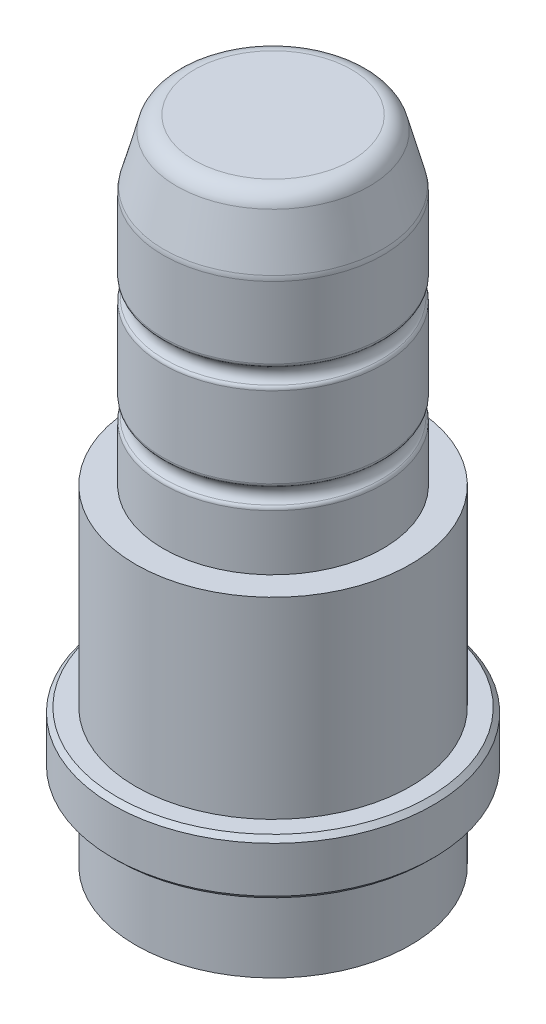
ISO-10303-21;
HEADER;
FILE_DESCRIPTION(('STEP AP214'),'2;1');
FILE_NAME('part.step','',(''),(''),'','','');
FILE_SCHEMA(('AUTOMOTIVE_DESIGN { 1 0 10303 214 1 1 1 1 }'));
ENDSEC;
DATA;
#1=APPLICATION_CONTEXT('core data for automotive mechanical design processes');
#2=APPLICATION_PROTOCOL_DEFINITION('international standard','automotive_design',2000,#1);
#3=PRODUCT_CONTEXT('',#1,'mechanical');
#4=PRODUCT('Part','Part','',(#3));
#5=PRODUCT_RELATED_PRODUCT_CATEGORY('part','',(#4));
#6=PRODUCT_DEFINITION_FORMATION('','',#4);
#7=PRODUCT_DEFINITION_CONTEXT('part definition',#1,'design');
#8=PRODUCT_DEFINITION('design','',#6,#7);
#9=PRODUCT_DEFINITION_SHAPE('','',#8);
#10=(LENGTH_UNIT() NAMED_UNIT(*) SI_UNIT(.MILLI.,.METRE.));
#11=(NAMED_UNIT(*) PLANE_ANGLE_UNIT() SI_UNIT($,.RADIAN.));
#12=(NAMED_UNIT(*) SI_UNIT($,.STERADIAN.) SOLID_ANGLE_UNIT());
#13=UNCERTAINTY_MEASURE_WITH_UNIT(LENGTH_MEASURE(1.E-05),#10,'distance_accuracy_value','');
#14=(GEOMETRIC_REPRESENTATION_CONTEXT(3) GLOBAL_UNCERTAINTY_ASSIGNED_CONTEXT((#13)) GLOBAL_UNIT_ASSIGNED_CONTEXT((#10,
#11,#12)) REPRESENTATION_CONTEXT('',''));
#15=CARTESIAN_POINT('',(0.,0.,0.));
#16=DIRECTION('',(0.,0.,1.));
#17=DIRECTION('',(1.,0.,0.));
#18=AXIS2_PLACEMENT_3D('',#15,#16,#17);
#19=CARTESIAN_POINT('',(0.,6.,0.));
#20=DIRECTION('',(0.,-1.,0.));
#21=DIRECTION('',(0.,0.,-1.));
#22=AXIS2_PLACEMENT_3D('',#19,#20,#21);
#23=CYLINDRICAL_SURFACE('',#22,17.5);
#24=CARTESIAN_POINT('',(0.,5.5,0.));
#25=DIRECTION('',(0.,1.,0.));
#26=DIRECTION('',(0.,0.,1.));
#27=AXIS2_PLACEMENT_3D('',#24,#25,#26);
#28=CIRCLE('',#27,17.5);
#29=CARTESIAN_POINT('',(0.,5.5,17.5));
#30=VERTEX_POINT('',#29);
#31=EDGE_CURVE('E21',#30,#30,#28,.F.);
#32=ORIENTED_EDGE('',*,*,#31,.T.);
#33=EDGE_LOOP('',(#32));
#34=FACE_BOUND('',#33,.T.);
#35=CARTESIAN_POINT('',(0.,0.500000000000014,0.));
#36=DIRECTION('',(0.,1.,0.));
#37=DIRECTION('',(0.,0.,1.));
#38=AXIS2_PLACEMENT_3D('',#35,#36,#37);
#39=CIRCLE('',#38,17.5);
#40=CARTESIAN_POINT('',(0.,0.500000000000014,17.5));
#41=VERTEX_POINT('',#40);
#42=EDGE_CURVE('E29',#41,#41,#39,.T.);
#43=ORIENTED_EDGE('',*,*,#42,.T.);
#44=EDGE_LOOP('',(#43));
#45=FACE_BOUND('',#44,.T.);
#46=ADVANCED_FACE('F13',(#34,#45),#23,.T.);
#47=CARTESIAN_POINT('',(0.,6.,0.));
#48=DIRECTION('',(0.,1.,0.));
#49=DIRECTION('',(0.,0.,1.));
#50=AXIS2_PLACEMENT_3D('',#47,#48,#49);
#51=PLANE('',#50);
#52=CARTESIAN_POINT('',(0.,6.,0.));
#53=DIRECTION('',(0.,1.,0.));
#54=DIRECTION('',(0.,0.,1.));
#55=AXIS2_PLACEMENT_3D('',#52,#53,#54);
#56=CIRCLE('',#55,17.);
#57=CARTESIAN_POINT('',(0.,6.,17.));
#58=VERTEX_POINT('',#57);
#59=EDGE_CURVE('E36',#58,#58,#56,.T.);
#60=ORIENTED_EDGE('',*,*,#59,.T.);
#61=EDGE_LOOP('',(#60));
#62=FACE_BOUND('',#61,.T.);
#63=CARTESIAN_POINT('',(0.,6.,0.));
#64=DIRECTION('',(0.,-1.,0.));
#65=DIRECTION('',(0.,0.,-1.));
#66=AXIS2_PLACEMENT_3D('',#63,#64,#65);
#67=CIRCLE('',#66,15.);
#68=CARTESIAN_POINT('',(0.,6.,-15.));
#69=VERTEX_POINT('',#68);
#70=EDGE_CURVE('E47',#69,#69,#67,.T.);
#71=ORIENTED_EDGE('',*,*,#70,.T.);
#72=EDGE_LOOP('',(#71));
#73=FACE_BOUND('',#72,.T.);
#74=ADVANCED_FACE('F124',(#62,#73),#51,.T.);
#75=CARTESIAN_POINT('',(0.,0.,0.));
#76=DIRECTION('',(0.,1.,0.));
#77=DIRECTION('',(0.,0.,1.));
#78=AXIS2_PLACEMENT_3D('',#75,#76,#77);
#79=PLANE('',#78);
#80=CARTESIAN_POINT('',(0.,0.,0.));
#81=DIRECTION('',(0.,1.,0.));
#82=DIRECTION('',(0.,0.,1.));
#83=AXIS2_PLACEMENT_3D('',#80,#81,#82);
#84=CIRCLE('',#83,17.);
#85=CARTESIAN_POINT('',(0.,0.,17.));
#86=VERTEX_POINT('',#85);
#87=EDGE_CURVE('E8',#86,#86,#84,.F.);
#88=ORIENTED_EDGE('',*,*,#87,.T.);
#89=EDGE_LOOP('',(#88));
#90=FACE_BOUND('',#89,.T.);
#91=CARTESIAN_POINT('',(0.,0.,0.));
#92=DIRECTION('',(0.,1.,0.));
#93=DIRECTION('',(0.,0.,1.));
#94=AXIS2_PLACEMENT_3D('',#91,#92,#93);
#95=CIRCLE('',#94,15.);
#96=CARTESIAN_POINT('',(0.,0.,15.));
#97=VERTEX_POINT('',#96);
#98=EDGE_CURVE('E102',#97,#97,#95,.T.);
#99=ORIENTED_EDGE('',*,*,#98,.T.);
#100=EDGE_LOOP('',(#99));
#101=FACE_BOUND('',#100,.T.);
#102=ADVANCED_FACE('F107',(#90,#101),#79,.F.);
#103=CARTESIAN_POINT('',(0.,27.,0.));
#104=DIRECTION('',(0.,-1.,0.));
#105=DIRECTION('',(0.,0.,-1.));
#106=AXIS2_PLACEMENT_3D('',#103,#104,#105);
#107=PLANE('',#106);
#108=CARTESIAN_POINT('',(0.,27.,0.));
#109=DIRECTION('',(0.,1.,0.));
#110=DIRECTION('',(0.,0.,1.));
#111=AXIS2_PLACEMENT_3D('',#108,#109,#110);
#112=CIRCLE('',#111,12.);
#113=CARTESIAN_POINT('',(0.,27.,12.));
#114=VERTEX_POINT('',#113);
#115=EDGE_CURVE('E42',#114,#114,#112,.T.);
#116=ORIENTED_EDGE('',*,*,#115,.F.);
#117=EDGE_LOOP('',(#116));
#118=FACE_BOUND('',#117,.T.);
#119=CARTESIAN_POINT('',(0.,27.,0.));
#120=DIRECTION('',(0.,-1.,0.));
#121=DIRECTION('',(0.,0.,-1.));
#122=AXIS2_PLACEMENT_3D('',#119,#120,#121);
#123=CIRCLE('',#122,15.);
#124=CARTESIAN_POINT('',(0.,27.,-15.));
#125=VERTEX_POINT('',#124);
#126=EDGE_CURVE('E43',#125,#125,#123,.T.);
#127=ORIENTED_EDGE('',*,*,#126,.F.);
#128=EDGE_LOOP('',(#127));
#129=FACE_BOUND('',#128,.T.);
#130=ADVANCED_FACE('F133',(#118,#129),#107,.F.);
#131=CARTESIAN_POINT('',(0.,6.,0.));
#132=DIRECTION('',(0.,-1.,0.));
#133=DIRECTION('',(0.,0.,-1.));
#134=AXIS2_PLACEMENT_3D('',#131,#132,#133);
#135=CYLINDRICAL_SURFACE('',#134,15.);
#136=ORIENTED_EDGE('',*,*,#70,.F.);
#137=EDGE_LOOP('',(#136));
#138=FACE_BOUND('',#137,.T.);
#139=ORIENTED_EDGE('',*,*,#126,.T.);
#140=EDGE_LOOP('',(#139));
#141=FACE_BOUND('',#140,.T.);
#142=ADVANCED_FACE('F137',(#138,#141),#135,.T.);
#143=CARTESIAN_POINT('',(0.,62.,0.));
#144=DIRECTION('',(0.,1.,0.));
#145=DIRECTION('',(0.,0.,1.));
#146=AXIS2_PLACEMENT_3D('',#143,#144,#145);
#147=PLANE('',#146);
#148=CARTESIAN_POINT('',(0.,62.,0.));
#149=DIRECTION('',(0.,1.,0.));
#150=DIRECTION('',(0.,0.,1.));
#151=AXIS2_PLACEMENT_3D('',#148,#149,#150);
#152=CIRCLE('',#151,8.58970167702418);
#153=CARTESIAN_POINT('',(0.,62.,8.58970167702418));
#154=VERTEX_POINT('',#153);
#155=EDGE_CURVE('E50',#154,#154,#152,.T.);
#156=ORIENTED_EDGE('',*,*,#155,.T.);
#157=EDGE_LOOP('',(#156));
#158=FACE_BOUND('',#157,.T.);
#159=ADVANCED_FACE('F141',(#158),#147,.T.);
#160=CARTESIAN_POINT('',(0.,60.,0.));
#161=DIRECTION('',(0.,1.,0.));
#162=DIRECTION('',(0.,0.,1.));
#163=AXIS2_PLACEMENT_3D('',#160,#161,#162);
#164=TOROIDAL_SURFACE('',#163,8.58970167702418,2.);
#165=CARTESIAN_POINT('',(0.,60.517638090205,0.));
#166=DIRECTION('',(0.,1.,0.));
#167=DIRECTION('',(0.,0.,1.));
#168=AXIS2_PLACEMENT_3D('',#165,#166,#167);
#169=CIRCLE('',#168,10.5215533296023);
#170=CARTESIAN_POINT('',(0.,60.517638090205,10.5215533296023));
#171=VERTEX_POINT('',#170);
#172=EDGE_CURVE('E53',#171,#171,#169,.T.);
#173=ORIENTED_EDGE('',*,*,#172,.T.);
#174=EDGE_LOOP('',(#173));
#175=FACE_BOUND('',#174,.T.);
#176=ORIENTED_EDGE('',*,*,#155,.F.);
#177=EDGE_LOOP('',(#176));
#178=FACE_BOUND('',#177,.T.);
#179=ADVANCED_FACE('F145',(#175,#178),#164,.T.);
#180=CARTESIAN_POINT('',(0.,60.517638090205,0.));
#181=DIRECTION('',(0.,-1.,0.));
#182=DIRECTION('',(0.,0.,-1.));
#183=AXIS2_PLACEMENT_3D('',#180,#181,#182);
#184=CONICAL_SURFACE('',#183,10.5215533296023,0.261799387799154);
#185=CARTESIAN_POINT('',(0.,55.2543330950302,0.));
#186=DIRECTION('',(0.,1.,0.));
#187=DIRECTION('',(0.,0.,1.));
#188=AXIS2_PLACEMENT_3D('',#185,#186,#187);
#189=CIRCLE('',#188,11.9318516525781);
#190=CARTESIAN_POINT('',(0.,55.2543330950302,11.9318516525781));
#191=VERTEX_POINT('',#190);
#192=EDGE_CURVE('E57',#191,#191,#189,.T.);
#193=ORIENTED_EDGE('',*,*,#192,.T.);
#194=EDGE_LOOP('',(#193));
#195=FACE_BOUND('',#194,.T.);
#196=ORIENTED_EDGE('',*,*,#172,.F.);
#197=EDGE_LOOP('',(#196));
#198=FACE_BOUND('',#197,.T.);
#199=ADVANCED_FACE('F149',(#195,#198),#184,.T.);
#200=CARTESIAN_POINT('',(0.,54.7366950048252,0.));
#201=DIRECTION('',(0.,1.,0.));
#202=DIRECTION('',(0.,0.,1.));
#203=AXIS2_PLACEMENT_3D('',#200,#201,#202);
#204=TOROIDAL_SURFACE('',#203,10.,2.);
#205=CARTESIAN_POINT('',(0.,54.7366950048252,0.));
#206=DIRECTION('',(0.,1.,0.));
#207=DIRECTION('',(0.,0.,1.));
#208=AXIS2_PLACEMENT_3D('',#205,#206,#207);
#209=CIRCLE('',#208,12.);
#210=CARTESIAN_POINT('',(0.,54.7366950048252,12.));
#211=VERTEX_POINT('',#210);
#212=EDGE_CURVE('E61',#211,#211,#209,.T.);
#213=ORIENTED_EDGE('',*,*,#212,.T.);
#214=EDGE_LOOP('',(#213));
#215=FACE_BOUND('',#214,.T.);
#216=ORIENTED_EDGE('',*,*,#192,.F.);
#217=EDGE_LOOP('',(#216));
#218=FACE_BOUND('',#217,.T.);
#219=ADVANCED_FACE('F153',(#215,#218),#204,.T.);
#220=CARTESIAN_POINT('',(0.,62.,0.));
#221=DIRECTION('',(0.,1.,0.));
#222=DIRECTION('',(0.,0.,1.));
#223=AXIS2_PLACEMENT_3D('',#220,#221,#222);
#224=CYLINDRICAL_SURFACE('',#223,12.);
#225=CARTESIAN_POINT('',(0.,46.9386863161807,0.));
#226=DIRECTION('',(0.,1.,0.));
#227=DIRECTION('',(0.,0.,1.));
#228=AXIS2_PLACEMENT_3D('',#225,#226,#227);
#229=CIRCLE('',#228,12.);
#230=CARTESIAN_POINT('',(0.,46.9386863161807,12.));
#231=VERTEX_POINT('',#230);
#232=EDGE_CURVE('E65',#231,#231,#229,.T.);
#233=ORIENTED_EDGE('',*,*,#232,.T.);
#234=EDGE_LOOP('',(#233));
#235=FACE_BOUND('',#234,.T.);
#236=ORIENTED_EDGE('',*,*,#212,.F.);
#237=EDGE_LOOP('',(#236));
#238=FACE_BOUND('',#237,.T.);
#239=ADVANCED_FACE('F157',(#235,#238),#224,.T.);
#240=CARTESIAN_POINT('',(0.,46.9386863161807,0.));
#241=DIRECTION('',(0.,1.,0.));
#242=DIRECTION('',(0.,0.,1.));
#243=AXIS2_PLACEMENT_3D('',#240,#241,#242);
#244=TOROIDAL_SURFACE('',#243,11.5,0.5);
#245=CARTESIAN_POINT('',(0.,46.545610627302,0.));
#246=DIRECTION('',(0.,1.,0.));
#247=DIRECTION('',(0.,0.,1.));
#248=AXIS2_PLACEMENT_3D('',#245,#246,#247);
#249=CIRCLE('',#248,11.8090169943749);
#250=CARTESIAN_POINT('',(0.,46.545610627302,11.8090169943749));
#251=VERTEX_POINT('',#250);
#252=EDGE_CURVE('E69',#251,#251,#249,.T.);
#253=ORIENTED_EDGE('',*,*,#252,.T.);
#254=EDGE_LOOP('',(#253));
#255=FACE_BOUND('',#254,.T.);
#256=ORIENTED_EDGE('',*,*,#232,.F.);
#257=EDGE_LOOP('',(#256));
#258=FACE_BOUND('',#257,.T.);
#259=ADVANCED_FACE('F161',(#255,#258),#244,.T.);
#260=CARTESIAN_POINT('',(0.,45.6666666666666,0.));
#261=DIRECTION('',(0.,1.,0.));
#262=DIRECTION('',(0.,0.,1.));
#263=AXIS2_PLACEMENT_3D('',#260,#261,#262);
#264=TOROIDAL_SURFACE('',#263,12.5,1.11803398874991);
#265=CARTESIAN_POINT('',(0.,44.7877227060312,0.));
#266=DIRECTION('',(0.,1.,0.));
#267=DIRECTION('',(0.,0.,1.));
#268=AXIS2_PLACEMENT_3D('',#265,#266,#267);
#269=CIRCLE('',#268,11.8090169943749);
#270=CARTESIAN_POINT('',(0.,44.7877227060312,11.8090169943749));
#271=VERTEX_POINT('',#270);
#272=EDGE_CURVE('E73',#271,#271,#269,.T.);
#273=ORIENTED_EDGE('',*,*,#272,.T.);
#274=EDGE_LOOP('',(#273));
#275=FACE_BOUND('',#274,.T.);
#276=ORIENTED_EDGE('',*,*,#252,.F.);
#277=EDGE_LOOP('',(#276));
#278=FACE_BOUND('',#277,.T.);
#279=ADVANCED_FACE('F165',(#275,#278),#264,.F.);
#280=CARTESIAN_POINT('',(0.,44.3946470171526,0.));
#281=DIRECTION('',(0.,1.,0.));
#282=DIRECTION('',(0.,0.,1.));
#283=AXIS2_PLACEMENT_3D('',#280,#281,#282);
#284=TOROIDAL_SURFACE('',#283,11.5,0.5);
#285=CARTESIAN_POINT('',(0.,44.3946470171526,0.));
#286=DIRECTION('',(0.,1.,0.));
#287=DIRECTION('',(0.,0.,1.));
#288=AXIS2_PLACEMENT_3D('',#285,#286,#287);
#289=CIRCLE('',#288,12.);
#290=CARTESIAN_POINT('',(0.,44.3946470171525,12.));
#291=VERTEX_POINT('',#290);
#292=EDGE_CURVE('E76',#291,#291,#289,.T.);
#293=ORIENTED_EDGE('',*,*,#292,.T.);
#294=EDGE_LOOP('',(#293));
#295=FACE_BOUND('',#294,.T.);
#296=ORIENTED_EDGE('',*,*,#272,.F.);
#297=EDGE_LOOP('',(#296));
#298=FACE_BOUND('',#297,.T.);
#299=ADVANCED_FACE('F169',(#295,#298),#284,.T.);
#300=CARTESIAN_POINT('',(0.,62.,0.));
#301=DIRECTION('',(0.,1.,0.));
#302=DIRECTION('',(0.,0.,1.));
#303=AXIS2_PLACEMENT_3D('',#300,#301,#302);
#304=CYLINDRICAL_SURFACE('',#303,12.);
#305=CARTESIAN_POINT('',(0.,35.6053529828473,0.));
#306=DIRECTION('',(0.,1.,0.));
#307=DIRECTION('',(0.,0.,1.));
#308=AXIS2_PLACEMENT_3D('',#305,#306,#307);
#309=CIRCLE('',#308,12.);
#310=CARTESIAN_POINT('',(0.,35.6053529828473,12.));
#311=VERTEX_POINT('',#310);
#312=EDGE_CURVE('E79',#311,#311,#309,.T.);
#313=ORIENTED_EDGE('',*,*,#312,.T.);
#314=EDGE_LOOP('',(#313));
#315=FACE_BOUND('',#314,.T.);
#316=ORIENTED_EDGE('',*,*,#292,.F.);
#317=EDGE_LOOP('',(#316));
#318=FACE_BOUND('',#317,.T.);
#319=ADVANCED_FACE('F173',(#315,#318),#304,.T.);
#320=CARTESIAN_POINT('',(0.,35.6053529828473,0.));
#321=DIRECTION('',(0.,1.,0.));
#322=DIRECTION('',(0.,0.,1.));
#323=AXIS2_PLACEMENT_3D('',#320,#321,#322);
#324=TOROIDAL_SURFACE('',#323,11.5,0.5);
#325=CARTESIAN_POINT('',(0.,35.2122772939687,0.));
#326=DIRECTION('',(0.,1.,0.));
#327=DIRECTION('',(0.,0.,1.));
#328=AXIS2_PLACEMENT_3D('',#325,#326,#327);
#329=CIRCLE('',#328,11.8090169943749);
#330=CARTESIAN_POINT('',(0.,35.2122772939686,11.8090169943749));
#331=VERTEX_POINT('',#330);
#332=EDGE_CURVE('E83',#331,#331,#329,.T.);
#333=ORIENTED_EDGE('',*,*,#332,.T.);
#334=EDGE_LOOP('',(#333));
#335=FACE_BOUND('',#334,.T.);
#336=ORIENTED_EDGE('',*,*,#312,.F.);
#337=EDGE_LOOP('',(#336));
#338=FACE_BOUND('',#337,.T.);
#339=ADVANCED_FACE('F177',(#335,#338),#324,.T.);
#340=CARTESIAN_POINT('',(0.,34.3333333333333,0.));
#341=DIRECTION('',(0.,1.,0.));
#342=DIRECTION('',(0.,0.,1.));
#343=AXIS2_PLACEMENT_3D('',#340,#341,#342);
#344=TOROIDAL_SURFACE('',#343,12.5,1.11803398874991);
#345=CARTESIAN_POINT('',(0.,33.4543893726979,0.));
#346=DIRECTION('',(0.,1.,0.));
#347=DIRECTION('',(0.,0.,1.));
#348=AXIS2_PLACEMENT_3D('',#345,#346,#347);
#349=CIRCLE('',#348,11.8090169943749);
#350=CARTESIAN_POINT('',(0.,33.4543893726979,11.8090169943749));
#351=VERTEX_POINT('',#350);
#352=EDGE_CURVE('E87',#351,#351,#349,.T.);
#353=ORIENTED_EDGE('',*,*,#352,.T.);
#354=EDGE_LOOP('',(#353));
#355=FACE_BOUND('',#354,.T.);
#356=ORIENTED_EDGE('',*,*,#332,.F.);
#357=EDGE_LOOP('',(#356));
#358=FACE_BOUND('',#357,.T.);
#359=ADVANCED_FACE('F181',(#355,#358),#344,.F.);
#360=CARTESIAN_POINT('',(0.,33.0613136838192,0.));
#361=DIRECTION('',(0.,1.,0.));
#362=DIRECTION('',(0.,0.,1.));
#363=AXIS2_PLACEMENT_3D('',#360,#361,#362);
#364=TOROIDAL_SURFACE('',#363,11.5,0.5);
#365=CARTESIAN_POINT('',(0.,33.0613136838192,0.));
#366=DIRECTION('',(0.,1.,0.));
#367=DIRECTION('',(0.,0.,1.));
#368=AXIS2_PLACEMENT_3D('',#365,#366,#367);
#369=CIRCLE('',#368,12.);
#370=CARTESIAN_POINT('',(0.,33.0613136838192,12.));
#371=VERTEX_POINT('',#370);
#372=EDGE_CURVE('E91',#371,#371,#369,.T.);
#373=ORIENTED_EDGE('',*,*,#372,.T.);
#374=EDGE_LOOP('',(#373));
#375=FACE_BOUND('',#374,.T.);
#376=ORIENTED_EDGE('',*,*,#352,.F.);
#377=EDGE_LOOP('',(#376));
#378=FACE_BOUND('',#377,.T.);
#379=ADVANCED_FACE('F185',(#375,#378),#364,.T.);
#380=CARTESIAN_POINT('',(0.,62.,0.));
#381=DIRECTION('',(0.,1.,0.));
#382=DIRECTION('',(0.,0.,1.));
#383=AXIS2_PLACEMENT_3D('',#380,#381,#382);
#384=CYLINDRICAL_SURFACE('',#383,12.);
#385=ORIENTED_EDGE('',*,*,#115,.T.);
#386=EDGE_LOOP('',(#385));
#387=FACE_BOUND('',#386,.T.);
#388=ORIENTED_EDGE('',*,*,#372,.F.);
#389=EDGE_LOOP('',(#388));
#390=FACE_BOUND('',#389,.T.);
#391=ADVANCED_FACE('F120',(#387,#390),#384,.T.);
#392=CARTESIAN_POINT('',(0.,-9.,0.));
#393=DIRECTION('',(0.,-1.,0.));
#394=DIRECTION('',(0.,0.,-1.));
#395=AXIS2_PLACEMENT_3D('',#392,#393,#394);
#396=PLANE('',#395);
#397=CARTESIAN_POINT('',(0.,-9.,0.));
#398=DIRECTION('',(0.,1.,0.));
#399=DIRECTION('',(0.,0.,1.));
#400=AXIS2_PLACEMENT_3D('',#397,#398,#399);
#401=CIRCLE('',#400,15.);
#402=CARTESIAN_POINT('',(0.,-9.,15.));
#403=VERTEX_POINT('',#402);
#404=EDGE_CURVE('E95',#403,#403,#401,.T.);
#405=ORIENTED_EDGE('',*,*,#404,.F.);
#406=EDGE_LOOP('',(#405));
#407=FACE_BOUND('',#406,.T.);
#408=ADVANCED_FACE('F112',(#407),#396,.T.);
#409=CARTESIAN_POINT('',(0.,0.,0.));
#410=DIRECTION('',(0.,1.,0.));
#411=DIRECTION('',(0.,0.,1.));
#412=AXIS2_PLACEMENT_3D('',#409,#410,#411);
#413=CYLINDRICAL_SURFACE('',#412,15.);
#414=ORIENTED_EDGE('',*,*,#404,.T.);
#415=EDGE_LOOP('',(#414));
#416=FACE_BOUND('',#415,.T.);
#417=ORIENTED_EDGE('',*,*,#98,.F.);
#418=EDGE_LOOP('',(#417));
#419=FACE_BOUND('',#418,.T.);
#420=ADVANCED_FACE('F109',(#416,#419),#413,.T.);
#421=CARTESIAN_POINT('',(0.,6.,0.));
#422=DIRECTION('',(0.,-1.,0.));
#423=DIRECTION('',(0.,0.,-1.));
#424=AXIS2_PLACEMENT_3D('',#421,#422,#423);
#425=CONICAL_SURFACE('',#424,17.,0.785398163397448);
#426=ORIENTED_EDGE('',*,*,#31,.F.);
#427=EDGE_LOOP('',(#426));
#428=FACE_BOUND('',#427,.T.);
#429=ORIENTED_EDGE('',*,*,#59,.F.);
#430=EDGE_LOOP('',(#429));
#431=FACE_BOUND('',#430,.T.);
#432=ADVANCED_FACE('F111',(#428,#431),#425,.T.);
#433=CARTESIAN_POINT('',(0.,0.500000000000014,0.));
#434=DIRECTION('',(0.,1.,0.));
#435=DIRECTION('',(0.,0.,1.));
#436=AXIS2_PLACEMENT_3D('',#433,#434,#435);
#437=CONICAL_SURFACE('',#436,17.5,0.785398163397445);
#438=ORIENTED_EDGE('',*,*,#87,.F.);
#439=EDGE_LOOP('',(#438));
#440=FACE_BOUND('',#439,.T.);
#441=ORIENTED_EDGE('',*,*,#42,.F.);
#442=EDGE_LOOP('',(#441));
#443=FACE_BOUND('',#442,.T.);
#444=ADVANCED_FACE('F15',(#440,#443),#437,.T.);
#445=CLOSED_SHELL('',(#46,#74,#102,#130,#142,#159,#179,#199,#219,#239,#259,#279,#299,#319,#339,
#359,#379,#391,#408,#420,#432,#444));
#446=MANIFOLD_SOLID_BREP('B1',#445);
#447=ADVANCED_BREP_SHAPE_REPRESENTATION('',(#18,#446),#14);
#448=SHAPE_DEFINITION_REPRESENTATION(#9,#447);
ENDSEC;
END-ISO-10303-21;
